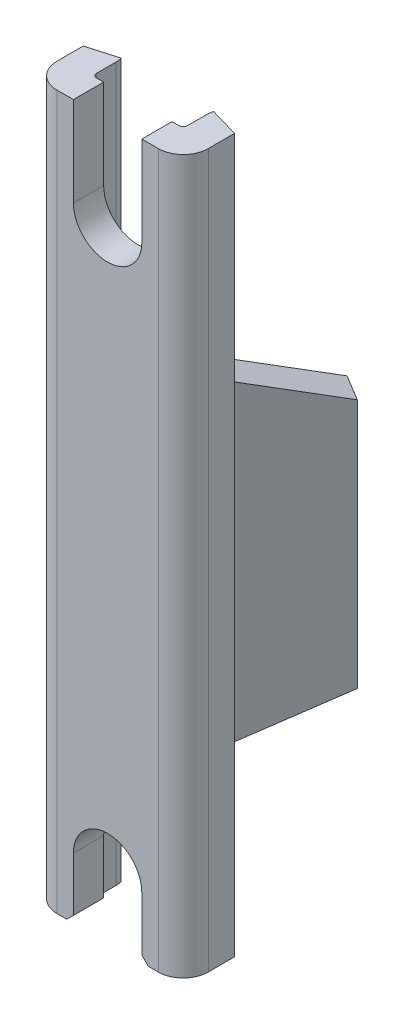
ISO-10303-21;
HEADER;
FILE_DESCRIPTION(('STEP AP214'),'2;1');
FILE_NAME('part.step','',(''),(''),'','','');
FILE_SCHEMA(('AUTOMOTIVE_DESIGN { 1 0 10303 214 1 1 1 1 }'));
ENDSEC;
DATA;
#1=APPLICATION_CONTEXT('core data for automotive mechanical design processes');
#2=APPLICATION_PROTOCOL_DEFINITION('international standard','automotive_design',2000,#1);
#3=PRODUCT_CONTEXT('',#1,'mechanical');
#4=PRODUCT('Part','Part','',(#3));
#5=PRODUCT_RELATED_PRODUCT_CATEGORY('part','',(#4));
#6=PRODUCT_DEFINITION_FORMATION('','',#4);
#7=PRODUCT_DEFINITION_CONTEXT('part definition',#1,'design');
#8=PRODUCT_DEFINITION('design','',#6,#7);
#9=PRODUCT_DEFINITION_SHAPE('','',#8);
#10=(LENGTH_UNIT() NAMED_UNIT(*) SI_UNIT(.MILLI.,.METRE.));
#11=(NAMED_UNIT(*) PLANE_ANGLE_UNIT() SI_UNIT($,.RADIAN.));
#12=(NAMED_UNIT(*) SI_UNIT($,.STERADIAN.) SOLID_ANGLE_UNIT());
#13=UNCERTAINTY_MEASURE_WITH_UNIT(LENGTH_MEASURE(1.E-05),#10,'distance_accuracy_value','');
#14=(GEOMETRIC_REPRESENTATION_CONTEXT(3) GLOBAL_UNCERTAINTY_ASSIGNED_CONTEXT((#13)) GLOBAL_UNIT_ASSIGNED_CONTEXT((#10,
#11,#12)) REPRESENTATION_CONTEXT('',''));
#15=CARTESIAN_POINT('',(0.,0.,0.));
#16=DIRECTION('',(0.,0.,1.));
#17=DIRECTION('',(1.,0.,0.));
#18=AXIS2_PLACEMENT_3D('',#15,#16,#17);
#19=CARTESIAN_POINT('',(0.,28.2,0.));
#20=DIRECTION('',(0.,1.,0.));
#21=DIRECTION('',(0.,0.,1.));
#22=AXIS2_PLACEMENT_3D('',#19,#20,#21);
#23=PLANE('',#22);
#24=DIRECTION('',(0.,0.,1.));
#25=VECTOR('',#24,1.);
#26=CARTESIAN_POINT('',(-2.6,28.2,-10.9133252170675));
#27=LINE('',#26,#25);
#28=CARTESIAN_POINT('',(-2.6,28.2,-2.3));
#29=VERTEX_POINT('',#28);
#30=CARTESIAN_POINT('',(-2.6,28.2,0.));
#31=VERTEX_POINT('',#30);
#32=EDGE_CURVE('E287',#29,#31,#27,.T.);
#33=ORIENTED_EDGE('',*,*,#32,.F.);
#34=DIRECTION('',(-1.,0.,0.));
#35=VECTOR('',#34,1.);
#36=CARTESIAN_POINT('',(3.44999999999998,28.2,-2.3));
#37=LINE('',#36,#35);
#38=CARTESIAN_POINT('',(-3.14999999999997,28.2,-2.3));
#39=VERTEX_POINT('',#38);
#40=EDGE_CURVE('E469',#29,#39,#37,.T.);
#41=ORIENTED_EDGE('',*,*,#40,.T.);
#42=CARTESIAN_POINT('',(-3.14999999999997,28.2,-2.6));
#43=DIRECTION('',(0.,-1.,0.));
#44=DIRECTION('',(0.,0.,1.));
#45=AXIS2_PLACEMENT_3D('',#42,#43,#44);
#46=CIRCLE('',#45,0.3);
#47=CARTESIAN_POINT('',(-3.44999999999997,28.2,-2.6));
#48=VERTEX_POINT('',#47);
#49=EDGE_CURVE('E412',#48,#39,#46,.F.);
#50=ORIENTED_EDGE('',*,*,#49,.F.);
#51=DIRECTION('',(0.,0.,1.));
#52=VECTOR('',#51,1.);
#53=CARTESIAN_POINT('',(-3.44999999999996,28.2,-4.53784645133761));
#54=LINE('',#53,#52);
#55=CARTESIAN_POINT('',(-3.44999999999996,28.2,-4.09412718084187));
#56=VERTEX_POINT('',#55);
#57=EDGE_CURVE('E386',#56,#48,#54,.T.);
#58=ORIENTED_EDGE('',*,*,#57,.F.);
#59=CARTESIAN_POINT('',(-5.04999999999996,28.2,-4.09412718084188));
#60=DIRECTION('',(0.,-1.,0.));
#61=DIRECTION('',(0.,0.,1.));
#62=AXIS2_PLACEMENT_3D('',#59,#60,#61);
#63=CIRCLE('',#62,1.6);
#64=CARTESIAN_POINT('',(-3.51374065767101,28.2,-4.54123704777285));
#65=VERTEX_POINT('',#64);
#66=EDGE_CURVE('E425',#65,#56,#63,.T.);
#67=ORIENTED_EDGE('',*,*,#66,.F.);
#68=DIRECTION('',(0.96126169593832,0.,-0.275637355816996));
#69=VECTOR('',#68,1.);
#70=CARTESIAN_POINT('',(-1.470204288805,28.2,-5.12721167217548));
#71=LINE('',#70,#69);
#72=CARTESIAN_POINT('',(-5.74999999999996,28.2,-3.9));
#73=VERTEX_POINT('',#72);
#74=EDGE_CURVE('E370',#73,#65,#71,.T.);
#75=ORIENTED_EDGE('',*,*,#74,.F.);
#76=DIRECTION('',(0.,0.,-1.));
#77=VECTOR('',#76,1.);
#78=CARTESIAN_POINT('',(-5.75,28.2,0.));
#79=LINE('',#78,#77);
#80=CARTESIAN_POINT('',(-5.74999999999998,28.2,-1.90000000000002));
#81=VERTEX_POINT('',#80);
#82=EDGE_CURVE('E381',#81,#73,#79,.T.);
#83=ORIENTED_EDGE('',*,*,#82,.F.);
#84=CARTESIAN_POINT('',(-3.84999999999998,28.2,-1.9));
#85=DIRECTION('',(0.,-1.,0.));
#86=DIRECTION('',(0.,0.,1.));
#87=AXIS2_PLACEMENT_3D('',#84,#85,#86);
#88=CIRCLE('',#87,1.9);
#89=CARTESIAN_POINT('',(-3.84999999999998,28.2,0.));
#90=VERTEX_POINT('',#89);
#91=EDGE_CURVE('E404',#90,#81,#88,.T.);
#92=ORIENTED_EDGE('',*,*,#91,.F.);
#93=DIRECTION('',(1.,0.,0.));
#94=VECTOR('',#93,1.);
#95=CARTESIAN_POINT('',(0.,28.2,0.));
#96=LINE('',#95,#94);
#97=EDGE_CURVE('E462',#90,#31,#96,.T.);
#98=ORIENTED_EDGE('',*,*,#97,.T.);
#99=EDGE_LOOP('',(#33,#41,#50,#58,#67,#75,#83,#92,#98));
#100=FACE_BOUND('',#99,.T.);
#101=ADVANCED_FACE('F50',(#100),#23,.T.);
#102=CARTESIAN_POINT('',(-9.25225890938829,-26.,80.3161799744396));
#103=DIRECTION('',(0.,1.,0.));
#104=DIRECTION('',(0.,0.,1.));
#105=AXIS2_PLACEMENT_3D('',#102,#103,#104);
#106=PLANE('',#105);
#107=DIRECTION('',(-1.,0.,0.));
#108=VECTOR('',#107,1.);
#109=CARTESIAN_POINT('',(3.44999999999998,-26.,-2.3));
#110=LINE('',#109,#108);
#111=CARTESIAN_POINT('',(-3.1,-26.,-2.3));
#112=VERTEX_POINT('',#111);
#113=CARTESIAN_POINT('',(-3.14999999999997,-26.,-2.3));
#114=VERTEX_POINT('',#113);
#115=EDGE_CURVE('E333',#112,#114,#110,.T.);
#116=ORIENTED_EDGE('',*,*,#115,.F.);
#117=DIRECTION('',(0.,0.,1.));
#118=VECTOR('',#117,1.);
#119=CARTESIAN_POINT('',(-3.1,-26.,80.3161799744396));
#120=LINE('',#119,#118);
#121=CARTESIAN_POINT('',(-3.1,-26.,0.));
#122=VERTEX_POINT('',#121);
#123=EDGE_CURVE('E518',#112,#122,#120,.T.);
#124=ORIENTED_EDGE('',*,*,#123,.T.);
#125=DIRECTION('',(1.,0.,0.));
#126=VECTOR('',#125,1.);
#127=CARTESIAN_POINT('',(0.,-26.,0.));
#128=LINE('',#127,#126);
#129=CARTESIAN_POINT('',(-3.84999999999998,-26.,0.));
#130=VERTEX_POINT('',#129);
#131=EDGE_CURVE('E337',#130,#122,#128,.T.);
#132=ORIENTED_EDGE('',*,*,#131,.F.);
#133=CARTESIAN_POINT('',(-3.84999999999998,-26.,-1.9));
#134=DIRECTION('',(0.,1.,0.));
#135=DIRECTION('',(0.,0.,1.));
#136=AXIS2_PLACEMENT_3D('',#133,#134,#135);
#137=CIRCLE('',#136,1.9);
#138=CARTESIAN_POINT('',(-5.74999999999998,-26.,-1.90000000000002));
#139=VERTEX_POINT('',#138);
#140=EDGE_CURVE('E330',#130,#139,#137,.F.);
#141=ORIENTED_EDGE('',*,*,#140,.T.);
#142=DIRECTION('',(0.,0.,1.));
#143=VECTOR('',#142,1.);
#144=CARTESIAN_POINT('',(-5.75,-26.,0.));
#145=LINE('',#144,#143);
#146=CARTESIAN_POINT('',(-5.74999999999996,-26.,-3.9));
#147=VERTEX_POINT('',#146);
#148=EDGE_CURVE('E326',#147,#139,#145,.T.);
#149=ORIENTED_EDGE('',*,*,#148,.F.);
#150=DIRECTION('',(0.96126169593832,0.,-0.275637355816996));
#151=VECTOR('',#150,1.);
#152=CARTESIAN_POINT('',(-5.74999999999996,-26.,-3.9));
#153=LINE('',#152,#151);
#154=CARTESIAN_POINT('',(-3.51374065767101,-26.,-4.54123704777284));
#155=VERTEX_POINT('',#154);
#156=EDGE_CURVE('E506',#147,#155,#153,.T.);
#157=ORIENTED_EDGE('',*,*,#156,.T.);
#158=CARTESIAN_POINT('',(-5.04999999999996,-26.,-4.09412718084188));
#159=DIRECTION('',(0.,1.,0.));
#160=DIRECTION('',(0.,0.,1.));
#161=AXIS2_PLACEMENT_3D('',#158,#159,#160);
#162=CIRCLE('',#161,1.6);
#163=CARTESIAN_POINT('',(-3.44999999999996,-26.,-4.09412718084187));
#164=VERTEX_POINT('',#163);
#165=EDGE_CURVE('E321',#155,#164,#162,.F.);
#166=ORIENTED_EDGE('',*,*,#165,.T.);
#167=DIRECTION('',(0.,0.,-1.));
#168=VECTOR('',#167,1.);
#169=CARTESIAN_POINT('',(-3.44999999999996,-26.,-4.53784645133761));
#170=LINE('',#169,#168);
#171=CARTESIAN_POINT('',(-3.44999999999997,-26.,-2.6));
#172=VERTEX_POINT('',#171);
#173=EDGE_CURVE('E324',#172,#164,#170,.T.);
#174=ORIENTED_EDGE('',*,*,#173,.F.);
#175=CARTESIAN_POINT('',(-3.14999999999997,-26.,-2.6));
#176=DIRECTION('',(0.,1.,0.));
#177=DIRECTION('',(0.,0.,1.));
#178=AXIS2_PLACEMENT_3D('',#175,#176,#177);
#179=CIRCLE('',#178,0.3);
#180=EDGE_CURVE('E328',#114,#172,#179,.F.);
#181=ORIENTED_EDGE('',*,*,#180,.F.);
#182=EDGE_LOOP('',(#116,#124,#132,#141,#149,#157,#166,#174,#181));
#183=FACE_BOUND('',#182,.T.);
#184=ADVANCED_FACE('F600',(#183),#106,.F.);
#185=CARTESIAN_POINT('',(5.74999999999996,28.2,-3.9));
#186=DIRECTION('',(-0.857167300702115,0.,-0.515038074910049));
#187=DIRECTION('',(-0.515038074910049,0.,0.857167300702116));
#188=AXIS2_PLACEMENT_3D('',#185,#186,#187);
#189=PLANE('',#188);
#190=DIRECTION('',(-0.486978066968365,0.32556815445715,0.810467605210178));
#191=VECTOR('',#190,1.);
#192=CARTESIAN_POINT('',(9.25225890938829,9.5,-9.72873764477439));
#193=LINE('',#192,#191);
#194=CARTESIAN_POINT('',(9.25225890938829,9.5,-9.72873764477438));
#195=VERTEX_POINT('',#194);
#196=CARTESIAN_POINT('',(5.74999999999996,11.8414277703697,-3.9));
#197=VERTEX_POINT('',#196);
#198=EDGE_CURVE('E451',#195,#197,#193,.T.);
#199=ORIENTED_EDGE('',*,*,#198,.T.);
#200=DIRECTION('',(0.,-1.,0.));
#201=VECTOR('',#200,1.);
#202=CARTESIAN_POINT('',(5.74999999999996,28.2,-3.9));
#203=LINE('',#202,#201);
#204=CARTESIAN_POINT('',(5.74999999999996,-11.8414277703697,-3.9));
#205=VERTEX_POINT('',#204);
#206=EDGE_CURVE('E477',#197,#205,#203,.T.);
#207=ORIENTED_EDGE('',*,*,#206,.T.);
#208=DIRECTION('',(-0.486978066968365,-0.32556815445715,0.810467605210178));
#209=VECTOR('',#208,1.);
#210=CARTESIAN_POINT('',(9.25225890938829,-9.5,-9.72873764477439));
#211=LINE('',#210,#209);
#212=CARTESIAN_POINT('',(9.25225890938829,-9.5,-9.72873764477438));
#213=VERTEX_POINT('',#212);
#214=EDGE_CURVE('E431',#213,#205,#211,.T.);
#215=ORIENTED_EDGE('',*,*,#214,.F.);
#216=DIRECTION('',(0.,-1.,0.));
#217=VECTOR('',#216,1.);
#218=CARTESIAN_POINT('',(9.25225890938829,28.2,-9.72873764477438));
#219=LINE('',#218,#217);
#220=EDGE_CURVE('E475',#195,#213,#219,.T.);
#221=ORIENTED_EDGE('',*,*,#220,.F.);
#222=EDGE_LOOP('',(#199,#207,#215,#221));
#223=FACE_BOUND('',#222,.T.);
#224=ADVANCED_FACE('F565',(#223),#189,.F.);
#225=CARTESIAN_POINT('',(9.25225890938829,28.2,-9.72873764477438));
#226=DIRECTION('',(-0.51503807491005,0.,0.857167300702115));
#227=DIRECTION('',(0.857167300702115,0.,0.51503807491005));
#228=AXIS2_PLACEMENT_3D('',#225,#226,#227);
#229=PLANE('',#228);
#230=DIRECTION('',(0.857167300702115,0.,0.515038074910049));
#231=VECTOR('',#230,1.);
#232=CARTESIAN_POINT('',(-12.1769236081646,9.5,-22.6046895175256));
#233=LINE('',#232,#231);
#234=CARTESIAN_POINT('',(7.28077411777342,9.5,-10.9133252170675));
#235=VERTEX_POINT('',#234);
#236=EDGE_CURVE('E454',#235,#195,#233,.T.);
#237=ORIENTED_EDGE('',*,*,#236,.T.);
#238=ORIENTED_EDGE('',*,*,#220,.T.);
#239=DIRECTION('',(0.857167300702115,0.,0.515038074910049));
#240=VECTOR('',#239,1.);
#241=CARTESIAN_POINT('',(-12.1769236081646,-9.5,-22.6046895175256));
#242=LINE('',#241,#240);
#243=CARTESIAN_POINT('',(7.28077411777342,-9.5,-10.9133252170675));
#244=VERTEX_POINT('',#243);
#245=EDGE_CURVE('E434',#244,#213,#242,.T.);
#246=ORIENTED_EDGE('',*,*,#245,.F.);
#247=DIRECTION('',(0.,-1.,0.));
#248=VECTOR('',#247,1.);
#249=CARTESIAN_POINT('',(7.28077411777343,28.2,-10.9133252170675));
#250=LINE('',#249,#248);
#251=EDGE_CURVE('E473',#235,#244,#250,.T.);
#252=ORIENTED_EDGE('',*,*,#251,.F.);
#253=EDGE_LOOP('',(#237,#238,#246,#252));
#254=FACE_BOUND('',#253,.T.);
#255=ADVANCED_FACE('F592',(#254),#229,.F.);
#256=CARTESIAN_POINT('',(7.28077411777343,28.2,-10.9133252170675));
#257=DIRECTION('',(0.857167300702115,0.,0.515038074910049));
#258=DIRECTION('',(0.515038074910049,0.,-0.857167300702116));
#259=AXIS2_PLACEMENT_3D('',#256,#257,#258);
#260=PLANE('',#259);
#261=ORIENTED_EDGE('',*,*,#251,.T.);
#262=DIRECTION('',(0.486978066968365,0.32556815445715,-0.810467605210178));
#263=VECTOR('',#262,1.);
#264=CARTESIAN_POINT('',(7.28077411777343,-9.5,-10.9133252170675));
#265=LINE('',#264,#263);
#266=CARTESIAN_POINT('',(3.67853231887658,-11.9082711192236,-4.91818810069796));
#267=VERTEX_POINT('',#266);
#268=EDGE_CURVE('E437',#267,#244,#265,.T.);
#269=ORIENTED_EDGE('',*,*,#268,.F.);
#270=DIRECTION('',(0.,-1.,0.));
#271=VECTOR('',#270,1.);
#272=CARTESIAN_POINT('',(3.67853231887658,28.2,-4.91818810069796));
#273=LINE('',#272,#271);
#274=CARTESIAN_POINT('',(3.67853231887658,11.9082711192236,-4.91818810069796));
#275=VERTEX_POINT('',#274);
#276=EDGE_CURVE('E498',#267,#275,#273,.F.);
#277=ORIENTED_EDGE('',*,*,#276,.T.);
#278=DIRECTION('',(0.486978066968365,-0.32556815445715,-0.810467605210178));
#279=VECTOR('',#278,1.);
#280=CARTESIAN_POINT('',(7.28077411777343,9.5,-10.9133252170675));
#281=LINE('',#280,#279);
#282=EDGE_CURVE('E457',#275,#235,#281,.T.);
#283=ORIENTED_EDGE('',*,*,#282,.T.);
#284=EDGE_LOOP('',(#261,#269,#277,#283));
#285=FACE_BOUND('',#284,.T.);
#286=ADVANCED_FACE('F590',(#285),#260,.F.);
#287=DIRECTION('',(0.,0.,1.));
#288=VECTOR('',#287,1.);
#289=CARTESIAN_POINT('',(2.6,28.2,-10.9133252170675));
#290=LINE('',#289,#288);
#291=CARTESIAN_POINT('',(2.6,28.2,-2.3));
#292=VERTEX_POINT('',#291);
#293=CARTESIAN_POINT('',(2.6,28.2,0.));
#294=VERTEX_POINT('',#293);
#295=EDGE_CURVE('E300',#292,#294,#290,.T.);
#296=ORIENTED_EDGE('',*,*,#295,.T.);
#297=CARTESIAN_POINT('',(3.84999999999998,28.2,0.));
#298=VERTEX_POINT('',#297);
#299=EDGE_CURVE('E459',#294,#298,#96,.T.);
#300=ORIENTED_EDGE('',*,*,#299,.T.);
#301=CARTESIAN_POINT('',(3.84999999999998,28.2,-1.9));
#302=DIRECTION('',(0.,1.,0.));
#303=DIRECTION('',(0.,0.,1.));
#304=AXIS2_PLACEMENT_3D('',#301,#302,#303);
#305=CIRCLE('',#304,1.9);
#306=CARTESIAN_POINT('',(5.74999999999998,28.2,-1.90000000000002));
#307=VERTEX_POINT('',#306);
#308=EDGE_CURVE('E486',#298,#307,#305,.T.);
#309=ORIENTED_EDGE('',*,*,#308,.T.);
#310=DIRECTION('',(0.,0.,-1.));
#311=VECTOR('',#310,1.);
#312=CARTESIAN_POINT('',(5.75,28.2,0.));
#313=LINE('',#312,#311);
#314=CARTESIAN_POINT('',(5.74999999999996,28.2,-3.9));
#315=VERTEX_POINT('',#314);
#316=EDGE_CURVE('E464',#307,#315,#313,.T.);
#317=ORIENTED_EDGE('',*,*,#316,.T.);
#318=DIRECTION('',(-0.96126169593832,0.,-0.275637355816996));
#319=VECTOR('',#318,1.);
#320=CARTESIAN_POINT('',(1.470204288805,28.2,-5.12721167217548));
#321=LINE('',#320,#319);
#322=CARTESIAN_POINT('',(3.51374065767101,28.2,-4.54123704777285));
#323=VERTEX_POINT('',#322);
#324=EDGE_CURVE('E447',#315,#323,#321,.T.);
#325=ORIENTED_EDGE('',*,*,#324,.T.);
#326=CARTESIAN_POINT('',(5.04999999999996,28.2,-4.09412718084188));
#327=DIRECTION('',(0.,1.,0.));
#328=DIRECTION('',(0.,0.,1.));
#329=AXIS2_PLACEMENT_3D('',#326,#327,#328);
#330=CIRCLE('',#329,1.6);
#331=CARTESIAN_POINT('',(3.44999999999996,28.2,-4.09412718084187));
#332=VERTEX_POINT('',#331);
#333=EDGE_CURVE('E504',#323,#332,#330,.T.);
#334=ORIENTED_EDGE('',*,*,#333,.T.);
#335=DIRECTION('',(0.,0.,1.));
#336=VECTOR('',#335,1.);
#337=CARTESIAN_POINT('',(3.44999999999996,28.2,-4.53784645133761));
#338=LINE('',#337,#336);
#339=CARTESIAN_POINT('',(3.44999999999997,28.2,-2.6));
#340=VERTEX_POINT('',#339);
#341=EDGE_CURVE('E466',#332,#340,#338,.T.);
#342=ORIENTED_EDGE('',*,*,#341,.T.);
#343=CARTESIAN_POINT('',(3.14999999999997,28.2,-2.6));
#344=DIRECTION('',(0.,1.,0.));
#345=DIRECTION('',(0.,0.,1.));
#346=AXIS2_PLACEMENT_3D('',#343,#344,#345);
#347=CIRCLE('',#346,0.3);
#348=CARTESIAN_POINT('',(3.14999999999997,28.2,-2.3));
#349=VERTEX_POINT('',#348);
#350=EDGE_CURVE('E493',#340,#349,#347,.F.);
#351=ORIENTED_EDGE('',*,*,#350,.T.);
#352=EDGE_CURVE('E470',#349,#292,#37,.T.);
#353=ORIENTED_EDGE('',*,*,#352,.T.);
#354=EDGE_LOOP('',(#296,#300,#309,#317,#325,#334,#342,#351,#353));
#355=FACE_BOUND('',#354,.T.);
#356=ADVANCED_FACE('F579',(#355),#23,.T.);
#357=CARTESIAN_POINT('',(0.,28.2,0.));
#358=DIRECTION('',(0.,0.,-1.));
#359=DIRECTION('',(-1.,0.,0.));
#360=AXIS2_PLACEMENT_3D('',#357,#358,#359);
#361=PLANE('',#360);
#362=ORIENTED_EDGE('',*,*,#131,.T.);
#363=DIRECTION('',(-0.707106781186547,-0.707106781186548,0.));
#364=VECTOR('',#363,1.);
#365=CARTESIAN_POINT('',(-3.1,-26.,0.));
#366=LINE('',#365,#364);
#367=CARTESIAN_POINT('',(-2.6,-25.5,0.));
#368=VERTEX_POINT('',#367);
#369=EDGE_CURVE('E523',#122,#368,#366,.F.);
#370=ORIENTED_EDGE('',*,*,#369,.T.);
#371=DIRECTION('',(0.,-1.,0.));
#372=VECTOR('',#371,1.);
#373=CARTESIAN_POINT('',(-2.6,-26.,0.));
#374=LINE('',#373,#372);
#375=CARTESIAN_POINT('',(-2.6,-21.4,0.));
#376=VERTEX_POINT('',#375);
#377=EDGE_CURVE('E308',#376,#368,#374,.T.);
#378=ORIENTED_EDGE('',*,*,#377,.F.);
#379=CARTESIAN_POINT('',(0.,-21.4,0.));
#380=DIRECTION('',(0.,0.,1.));
#381=DIRECTION('',(-1.,0.,0.));
#382=AXIS2_PLACEMENT_3D('',#379,#380,#381);
#383=CIRCLE('',#382,2.6);
#384=CARTESIAN_POINT('',(2.6,-21.4,0.));
#385=VERTEX_POINT('',#384);
#386=EDGE_CURVE('E305',#385,#376,#383,.T.);
#387=ORIENTED_EDGE('',*,*,#386,.F.);
#388=DIRECTION('',(0.,1.,0.));
#389=VECTOR('',#388,1.);
#390=CARTESIAN_POINT('',(2.6,-26.,0.));
#391=LINE('',#390,#389);
#392=CARTESIAN_POINT('',(2.6,-25.5,0.));
#393=VERTEX_POINT('',#392);
#394=EDGE_CURVE('E299',#393,#385,#391,.T.);
#395=ORIENTED_EDGE('',*,*,#394,.F.);
#396=DIRECTION('',(-0.707106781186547,0.707106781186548,0.));
#397=VECTOR('',#396,1.);
#398=CARTESIAN_POINT('',(3.1,-26.,0.));
#399=LINE('',#398,#397);
#400=CARTESIAN_POINT('',(3.1,-26.,0.));
#401=VERTEX_POINT('',#400);
#402=EDGE_CURVE('E521',#393,#401,#399,.F.);
#403=ORIENTED_EDGE('',*,*,#402,.T.);
#404=CARTESIAN_POINT('',(3.84999999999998,-26.,0.));
#405=VERTEX_POINT('',#404);
#406=EDGE_CURVE('E336',#401,#405,#128,.T.);
#407=ORIENTED_EDGE('',*,*,#406,.T.);
#408=DIRECTION('',(0.,-1.,0.));
#409=VECTOR('',#408,1.);
#410=CARTESIAN_POINT('',(3.84999999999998,28.2,0.));
#411=LINE('',#410,#409);
#412=EDGE_CURVE('E483',#405,#298,#411,.F.);
#413=ORIENTED_EDGE('',*,*,#412,.T.);
#414=ORIENTED_EDGE('',*,*,#299,.F.);
#415=DIRECTION('',(0.,1.,0.));
#416=VECTOR('',#415,1.);
#417=CARTESIAN_POINT('',(2.6,28.2,0.));
#418=LINE('',#417,#416);
#419=CARTESIAN_POINT('',(2.6,21.4,0.));
#420=VERTEX_POINT('',#419);
#421=EDGE_CURVE('E281',#420,#294,#418,.T.);
#422=ORIENTED_EDGE('',*,*,#421,.F.);
#423=CARTESIAN_POINT('',(0.,21.4,0.));
#424=DIRECTION('',(0.,0.,1.));
#425=DIRECTION('',(1.,0.,0.));
#426=AXIS2_PLACEMENT_3D('',#423,#424,#425);
#427=CIRCLE('',#426,2.6);
#428=CARTESIAN_POINT('',(-2.6,21.4,0.));
#429=VERTEX_POINT('',#428);
#430=EDGE_CURVE('E274',#429,#420,#427,.T.);
#431=ORIENTED_EDGE('',*,*,#430,.F.);
#432=DIRECTION('',(0.,-1.,0.));
#433=VECTOR('',#432,1.);
#434=CARTESIAN_POINT('',(-2.6,28.2,0.));
#435=LINE('',#434,#433);
#436=EDGE_CURVE('E284',#31,#429,#435,.T.);
#437=ORIENTED_EDGE('',*,*,#436,.F.);
#438=ORIENTED_EDGE('',*,*,#97,.F.);
#439=DIRECTION('',(0.,-1.,0.));
#440=VECTOR('',#439,1.);
#441=CARTESIAN_POINT('',(-3.84999999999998,28.2,0.));
#442=LINE('',#441,#440);
#443=EDGE_CURVE('E402',#130,#90,#442,.F.);
#444=ORIENTED_EDGE('',*,*,#443,.F.);
#445=EDGE_LOOP('',(#362,#370,#378,#387,#395,#403,#407,#413,#414,#422,#431,#437,#438,#444));
#446=FACE_BOUND('',#445,.T.);
#447=ADVANCED_FACE('F293',(#446),#361,.F.);
#448=CARTESIAN_POINT('',(5.75,28.2,0.));
#449=DIRECTION('',(-1.,0.,0.));
#450=DIRECTION('',(0.,0.,1.));
#451=AXIS2_PLACEMENT_3D('',#448,#449,#450);
#452=PLANE('',#451);
#453=DIRECTION('',(0.,-1.,0.));
#454=VECTOR('',#453,1.);
#455=CARTESIAN_POINT('',(5.74999999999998,28.2,-1.90000000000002));
#456=LINE('',#455,#454);
#457=CARTESIAN_POINT('',(5.74999999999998,-26.,-1.90000000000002));
#458=VERTEX_POINT('',#457);
#459=EDGE_CURVE('E480',#307,#458,#456,.T.);
#460=ORIENTED_EDGE('',*,*,#459,.T.);
#461=DIRECTION('',(0.,0.,-1.));
#462=VECTOR('',#461,1.);
#463=CARTESIAN_POINT('',(5.75,-26.,0.));
#464=LINE('',#463,#462);
#465=CARTESIAN_POINT('',(5.74999999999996,-26.,-3.9));
#466=VERTEX_POINT('',#465);
#467=EDGE_CURVE('E346',#458,#466,#464,.T.);
#468=ORIENTED_EDGE('',*,*,#467,.T.);
#469=DIRECTION('',(0.,1.,0.));
#470=VECTOR('',#469,1.);
#471=CARTESIAN_POINT('',(5.74999999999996,-28.2,-3.9));
#472=LINE('',#471,#470);
#473=EDGE_CURVE('E440',#466,#205,#472,.T.);
#474=ORIENTED_EDGE('',*,*,#473,.T.);
#475=ORIENTED_EDGE('',*,*,#206,.F.);
#476=EDGE_CURVE('E478',#315,#197,#203,.T.);
#477=ORIENTED_EDGE('',*,*,#476,.F.);
#478=ORIENTED_EDGE('',*,*,#316,.F.);
#479=EDGE_LOOP('',(#460,#468,#474,#475,#477,#478));
#480=FACE_BOUND('',#479,.T.);
#481=ADVANCED_FACE('F569',(#480),#452,.F.);
#482=CARTESIAN_POINT('',(3.44999999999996,28.2,-4.53784645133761));
#483=DIRECTION('',(1.,0.,0.));
#484=DIRECTION('',(0.,0.,-1.));
#485=AXIS2_PLACEMENT_3D('',#482,#483,#484);
#486=PLANE('',#485);
#487=DIRECTION('',(0.,-1.,0.));
#488=VECTOR('',#487,1.);
#489=CARTESIAN_POINT('',(3.44999999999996,28.2,-4.09412718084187));
#490=LINE('',#489,#488);
#491=CARTESIAN_POINT('',(3.44999999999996,-26.,-4.09412718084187));
#492=VERTEX_POINT('',#491);
#493=EDGE_CURVE('E495',#332,#492,#490,.T.);
#494=ORIENTED_EDGE('',*,*,#493,.T.);
#495=DIRECTION('',(0.,0.,1.));
#496=VECTOR('',#495,1.);
#497=CARTESIAN_POINT('',(3.44999999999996,-26.,-4.53784645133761));
#498=LINE('',#497,#496);
#499=CARTESIAN_POINT('',(3.44999999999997,-26.,-2.6));
#500=VERTEX_POINT('',#499);
#501=EDGE_CURVE('E344',#492,#500,#498,.T.);
#502=ORIENTED_EDGE('',*,*,#501,.T.);
#503=DIRECTION('',(0.,-1.,0.));
#504=VECTOR('',#503,1.);
#505=CARTESIAN_POINT('',(3.44999999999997,28.2,-2.6));
#506=LINE('',#505,#504);
#507=EDGE_CURVE('E491',#500,#340,#506,.F.);
#508=ORIENTED_EDGE('',*,*,#507,.T.);
#509=ORIENTED_EDGE('',*,*,#341,.F.);
#510=EDGE_LOOP('',(#494,#502,#508,#509));
#511=FACE_BOUND('',#510,.T.);
#512=ADVANCED_FACE('F544',(#511),#486,.F.);
#513=CARTESIAN_POINT('',(3.44999999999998,28.2,-2.3));
#514=DIRECTION('',(0.,0.,1.));
#515=DIRECTION('',(1.,0.,0.));
#516=AXIS2_PLACEMENT_3D('',#513,#514,#515);
#517=PLANE('',#516);
#518=DIRECTION('',(0.,-1.,0.));
#519=VECTOR('',#518,1.);
#520=CARTESIAN_POINT('',(-2.6,28.2,-2.3));
#521=LINE('',#520,#519);
#522=CARTESIAN_POINT('',(-2.6,-21.4,-2.3));
#523=VERTEX_POINT('',#522);
#524=CARTESIAN_POINT('',(-2.59999999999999,-25.5,-2.3));
#525=VERTEX_POINT('',#524);
#526=EDGE_CURVE('E318',#523,#525,#521,.T.);
#527=ORIENTED_EDGE('',*,*,#526,.T.);
#528=DIRECTION('',(0.707106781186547,0.707106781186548,0.));
#529=VECTOR('',#528,1.);
#530=CARTESIAN_POINT('',(-3.1,-26.,-2.3));
#531=LINE('',#530,#529);
#532=EDGE_CURVE('E528',#525,#112,#531,.F.);
#533=ORIENTED_EDGE('',*,*,#532,.T.);
#534=ORIENTED_EDGE('',*,*,#115,.T.);
#535=DIRECTION('',(0.,-1.,0.));
#536=VECTOR('',#535,1.);
#537=CARTESIAN_POINT('',(-3.14999999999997,0.,-2.3));
#538=LINE('',#537,#536);
#539=EDGE_CURVE('E407',#39,#114,#538,.T.);
#540=ORIENTED_EDGE('',*,*,#539,.F.);
#541=ORIENTED_EDGE('',*,*,#40,.F.);
#542=DIRECTION('',(0.,-1.,0.));
#543=VECTOR('',#542,1.);
#544=CARTESIAN_POINT('',(-2.6,28.2,-2.3));
#545=LINE('',#544,#543);
#546=CARTESIAN_POINT('',(-2.6,21.4,-2.3));
#547=VERTEX_POINT('',#546);
#548=EDGE_CURVE('E516',#29,#547,#545,.T.);
#549=ORIENTED_EDGE('',*,*,#548,.T.);
#550=CARTESIAN_POINT('',(0.,21.4,-2.3));
#551=DIRECTION('',(0.,0.,1.));
#552=DIRECTION('',(1.,0.,0.));
#553=AXIS2_PLACEMENT_3D('',#550,#551,#552);
#554=CIRCLE('',#553,2.6);
#555=CARTESIAN_POINT('',(2.6,21.4,-2.3));
#556=VERTEX_POINT('',#555);
#557=EDGE_CURVE('E277',#547,#556,#554,.T.);
#558=ORIENTED_EDGE('',*,*,#557,.T.);
#559=DIRECTION('',(0.,1.,0.));
#560=VECTOR('',#559,1.);
#561=CARTESIAN_POINT('',(2.6,28.2,-2.3));
#562=LINE('',#561,#560);
#563=EDGE_CURVE('E513',#556,#292,#562,.T.);
#564=ORIENTED_EDGE('',*,*,#563,.T.);
#565=ORIENTED_EDGE('',*,*,#352,.F.);
#566=DIRECTION('',(0.,-1.,0.));
#567=VECTOR('',#566,1.);
#568=CARTESIAN_POINT('',(3.14999999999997,0.,-2.3));
#569=LINE('',#568,#567);
#570=CARTESIAN_POINT('',(3.14999999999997,-26.,-2.3));
#571=VERTEX_POINT('',#570);
#572=EDGE_CURVE('E488',#349,#571,#569,.T.);
#573=ORIENTED_EDGE('',*,*,#572,.T.);
#574=CARTESIAN_POINT('',(3.09999999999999,-26.,-2.3));
#575=VERTEX_POINT('',#574);
#576=EDGE_CURVE('E334',#571,#575,#110,.T.);
#577=ORIENTED_EDGE('',*,*,#576,.T.);
#578=DIRECTION('',(0.707106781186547,-0.707106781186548,0.));
#579=VECTOR('',#578,1.);
#580=CARTESIAN_POINT('',(3.09999999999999,-26.,-2.3));
#581=LINE('',#580,#579);
#582=CARTESIAN_POINT('',(2.6,-25.5,-2.3));
#583=VERTEX_POINT('',#582);
#584=EDGE_CURVE('E65',#575,#583,#581,.F.);
#585=ORIENTED_EDGE('',*,*,#584,.T.);
#586=DIRECTION('',(0.,1.,0.));
#587=VECTOR('',#586,1.);
#588=CARTESIAN_POINT('',(2.6,28.2,-2.3));
#589=LINE('',#588,#587);
#590=CARTESIAN_POINT('',(2.6,-21.4,-2.3));
#591=VERTEX_POINT('',#590);
#592=EDGE_CURVE('E314',#583,#591,#589,.T.);
#593=ORIENTED_EDGE('',*,*,#592,.T.);
#594=CARTESIAN_POINT('',(0.,-21.4,-2.3));
#595=DIRECTION('',(0.,0.,1.));
#596=DIRECTION('',(1.,0.,0.));
#597=AXIS2_PLACEMENT_3D('',#594,#595,#596);
#598=CIRCLE('',#597,2.6);
#599=EDGE_CURVE('E509',#591,#523,#598,.T.);
#600=ORIENTED_EDGE('',*,*,#599,.T.);
#601=EDGE_LOOP('',(#527,#533,#534,#540,#541,#549,#558,#564,#565,#573,#577,#585,#593,#600));
#602=FACE_BOUND('',#601,.T.);
#603=ADVANCED_FACE('F535',(#602),#517,.F.);
#604=CARTESIAN_POINT('',(5.74999999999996,0.,-3.9));
#605=DIRECTION('',(0.275637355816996,0.,-0.96126169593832));
#606=DIRECTION('',(-0.96126169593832,0.,-0.275637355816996));
#607=AXIS2_PLACEMENT_3D('',#604,#605,#606);
#608=PLANE('',#607);
#609=DIRECTION('',(-0.957467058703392,0.0887667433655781,-0.274549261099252));
#610=VECTOR('',#609,1.);
#611=CARTESIAN_POINT('',(-15.4023206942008,13.8024588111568,-9.96533035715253));
#612=LINE('',#611,#610);
#613=CARTESIAN_POINT('',(3.51374065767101,12.0487513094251,-4.54123704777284));
#614=VERTEX_POINT('',#613);
#615=EDGE_CURVE('E448',#197,#614,#612,.T.);
#616=ORIENTED_EDGE('',*,*,#615,.T.);
#617=DIRECTION('',(0.,-1.,0.));
#618=VECTOR('',#617,1.);
#619=CARTESIAN_POINT('',(3.51374065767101,12.0487513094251,-4.54123704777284));
#620=LINE('',#619,#618);
#621=EDGE_CURVE('E502',#614,#323,#620,.F.);
#622=ORIENTED_EDGE('',*,*,#621,.T.);
#623=ORIENTED_EDGE('',*,*,#324,.F.);
#624=ORIENTED_EDGE('',*,*,#476,.T.);
#625=EDGE_LOOP('',(#616,#622,#623,#624));
#626=FACE_BOUND('',#625,.T.);
#627=ADVANCED_FACE('F581',(#626),#608,.T.);
#628=CARTESIAN_POINT('',(-12.1769236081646,9.5,-22.6046895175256));
#629=DIRECTION('',(0.167679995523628,0.945518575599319,-0.279066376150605));
#630=DIRECTION('',(0.,0.283074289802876,0.959097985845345));
#631=AXIS2_PLACEMENT_3D('',#628,#629,#630);
#632=PLANE('',#631);
#633=ORIENTED_EDGE('',*,*,#282,.F.);
#634=CARTESIAN_POINT('',(5.04999999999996,11.9082711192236,-4.09412718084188));
#635=DIRECTION('',(0.167679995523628,0.945518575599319,-0.279066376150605));
#636=DIRECTION('',(0.486978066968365,-0.32556815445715,-0.810467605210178));
#637=AXIS2_PLACEMENT_3D('',#634,#635,#636);
#638=ELLIPSE('',#637,1.69219308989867,1.6);
#639=EDGE_CURVE('E500',#275,#614,#638,.T.);
#640=ORIENTED_EDGE('',*,*,#639,.T.);
#641=ORIENTED_EDGE('',*,*,#615,.F.);
#642=ORIENTED_EDGE('',*,*,#198,.F.);
#643=ORIENTED_EDGE('',*,*,#236,.F.);
#644=EDGE_LOOP('',(#633,#640,#641,#642,#643));
#645=FACE_BOUND('',#644,.T.);
#646=ADVANCED_FACE('F586',(#645),#632,.T.);
#647=CARTESIAN_POINT('',(3.84999999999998,28.2,-1.9));
#648=DIRECTION('',(0.,-1.,0.));
#649=DIRECTION('',(0.,0.,-1.));
#650=AXIS2_PLACEMENT_3D('',#647,#648,#649);
#651=CYLINDRICAL_SURFACE('',#650,1.9);
#652=CARTESIAN_POINT('',(3.84999999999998,-26.,-1.9));
#653=DIRECTION('',(0.,1.,0.));
#654=DIRECTION('',(0.,0.,1.));
#655=AXIS2_PLACEMENT_3D('',#652,#653,#654);
#656=CIRCLE('',#655,1.9);
#657=EDGE_CURVE('E341',#458,#405,#656,.F.);
#658=ORIENTED_EDGE('',*,*,#657,.F.);
#659=ORIENTED_EDGE('',*,*,#459,.F.);
#660=ORIENTED_EDGE('',*,*,#308,.F.);
#661=ORIENTED_EDGE('',*,*,#412,.F.);
#662=EDGE_LOOP('',(#658,#659,#660,#661));
#663=FACE_BOUND('',#662,.T.);
#664=ADVANCED_FACE('F575',(#663),#651,.T.);
#665=CARTESIAN_POINT('',(3.14999999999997,28.2,-2.6));
#666=DIRECTION('',(0.,1.,0.));
#667=DIRECTION('',(0.,0.,1.));
#668=AXIS2_PLACEMENT_3D('',#665,#666,#667);
#669=CYLINDRICAL_SURFACE('',#668,0.3);
#670=ORIENTED_EDGE('',*,*,#507,.F.);
#671=CARTESIAN_POINT('',(3.14999999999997,-26.,-2.6));
#672=DIRECTION('',(0.,1.,0.));
#673=DIRECTION('',(0.,0.,1.));
#674=AXIS2_PLACEMENT_3D('',#671,#672,#673);
#675=CIRCLE('',#674,0.3);
#676=EDGE_CURVE('E339',#500,#571,#675,.F.);
#677=ORIENTED_EDGE('',*,*,#676,.T.);
#678=ORIENTED_EDGE('',*,*,#572,.F.);
#679=ORIENTED_EDGE('',*,*,#350,.F.);
#680=EDGE_LOOP('',(#670,#677,#678,#679));
#681=FACE_BOUND('',#680,.T.);
#682=ADVANCED_FACE('F541',(#681),#669,.F.);
#683=CARTESIAN_POINT('',(5.04999999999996,28.2,-4.09412718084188));
#684=DIRECTION('',(0.,-1.,0.));
#685=DIRECTION('',(0.,0.,-1.));
#686=AXIS2_PLACEMENT_3D('',#683,#684,#685);
#687=CYLINDRICAL_SURFACE('',#686,1.6);
#688=CARTESIAN_POINT('',(5.04999999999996,-26.,-4.09412718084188));
#689=DIRECTION('',(0.,1.,0.));
#690=DIRECTION('',(0.,0.,1.));
#691=AXIS2_PLACEMENT_3D('',#688,#689,#690);
#692=CIRCLE('',#691,1.6);
#693=CARTESIAN_POINT('',(3.51374065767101,-26.,-4.54123704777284));
#694=VERTEX_POINT('',#693);
#695=EDGE_CURVE('E351',#492,#694,#692,.F.);
#696=ORIENTED_EDGE('',*,*,#695,.F.);
#697=ORIENTED_EDGE('',*,*,#493,.F.);
#698=ORIENTED_EDGE('',*,*,#333,.F.);
#699=ORIENTED_EDGE('',*,*,#621,.F.);
#700=ORIENTED_EDGE('',*,*,#639,.F.);
#701=ORIENTED_EDGE('',*,*,#276,.F.);
#702=CARTESIAN_POINT('',(5.04999999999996,-11.9082711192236,-4.09412718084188));
#703=DIRECTION('',(-0.167679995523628,0.945518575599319,0.279066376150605));
#704=DIRECTION('',(0.486978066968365,0.32556815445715,-0.810467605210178));
#705=AXIS2_PLACEMENT_3D('',#702,#703,#704);
#706=ELLIPSE('',#705,1.69219308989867,1.6);
#707=CARTESIAN_POINT('',(3.51374065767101,-12.0487513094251,-4.54123704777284));
#708=VERTEX_POINT('',#707);
#709=EDGE_CURVE('E442',#267,#708,#706,.T.);
#710=ORIENTED_EDGE('',*,*,#709,.T.);
#711=DIRECTION('',(0.,1.,0.));
#712=VECTOR('',#711,1.);
#713=CARTESIAN_POINT('',(3.51374065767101,-12.0487513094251,-4.54123704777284));
#714=LINE('',#713,#712);
#715=EDGE_CURVE('E444',#708,#694,#714,.F.);
#716=ORIENTED_EDGE('',*,*,#715,.T.);
#717=EDGE_LOOP('',(#696,#697,#698,#699,#700,#701,#710,#716));
#718=FACE_BOUND('',#717,.T.);
#719=ADVANCED_FACE('F549',(#718),#687,.T.);
#720=CARTESIAN_POINT('',(5.74999999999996,0.,-3.9));
#721=DIRECTION('',(0.275637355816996,0.,-0.96126169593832));
#722=DIRECTION('',(-0.96126169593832,0.,-0.275637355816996));
#723=AXIS2_PLACEMENT_3D('',#720,#721,#722);
#724=PLANE('',#723);
#725=DIRECTION('',(0.96126169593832,0.,0.275637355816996));
#726=VECTOR('',#725,1.);
#727=CARTESIAN_POINT('',(5.74999999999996,-26.,-3.9));
#728=LINE('',#727,#726);
#729=EDGE_CURVE('E348',#694,#466,#728,.T.);
#730=ORIENTED_EDGE('',*,*,#729,.F.);
#731=ORIENTED_EDGE('',*,*,#715,.F.);
#732=DIRECTION('',(-0.957467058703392,-0.0887667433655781,-0.274549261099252));
#733=VECTOR('',#732,1.);
#734=CARTESIAN_POINT('',(-15.4023206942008,-13.8024588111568,-9.96533035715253));
#735=LINE('',#734,#733);
#736=EDGE_CURVE('E428',#205,#708,#735,.T.);
#737=ORIENTED_EDGE('',*,*,#736,.F.);
#738=ORIENTED_EDGE('',*,*,#473,.F.);
#739=EDGE_LOOP('',(#730,#731,#737,#738));
#740=FACE_BOUND('',#739,.T.);
#741=ADVANCED_FACE('F555',(#740),#724,.T.);
#742=CARTESIAN_POINT('',(-12.1769236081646,-9.5,-22.6046895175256));
#743=DIRECTION('',(0.167679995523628,-0.945518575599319,-0.279066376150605));
#744=DIRECTION('',(0.,-0.283074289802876,0.959097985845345));
#745=AXIS2_PLACEMENT_3D('',#742,#743,#744);
#746=PLANE('',#745);
#747=ORIENTED_EDGE('',*,*,#268,.T.);
#748=ORIENTED_EDGE('',*,*,#245,.T.);
#749=ORIENTED_EDGE('',*,*,#214,.T.);
#750=ORIENTED_EDGE('',*,*,#736,.T.);
#751=ORIENTED_EDGE('',*,*,#709,.F.);
#752=EDGE_LOOP('',(#747,#748,#749,#750,#751));
#753=FACE_BOUND('',#752,.T.);
#754=ADVANCED_FACE('F558',(#753),#746,.T.);
#755=CARTESIAN_POINT('',(-5.74999999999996,28.2,-3.9));
#756=DIRECTION('',(0.857167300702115,0.,-0.515038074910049));
#757=DIRECTION('',(0.515038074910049,0.,0.857167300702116));
#758=AXIS2_PLACEMENT_3D('',#755,#756,#757);
#759=PLANE('',#758);
#760=DIRECTION('',(0.486978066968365,0.32556815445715,0.810467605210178));
#761=VECTOR('',#760,1.);
#762=CARTESIAN_POINT('',(-9.25225890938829,9.5,-9.72873764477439));
#763=LINE('',#762,#761);
#764=CARTESIAN_POINT('',(-9.25225890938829,9.5,-9.72873764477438));
#765=VERTEX_POINT('',#764);
#766=CARTESIAN_POINT('',(-5.74999999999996,11.8414277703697,-3.9));
#767=VERTEX_POINT('',#766);
#768=EDGE_CURVE('E374',#765,#767,#763,.T.);
#769=ORIENTED_EDGE('',*,*,#768,.F.);
#770=DIRECTION('',(0.,-1.,0.));
#771=VECTOR('',#770,1.);
#772=CARTESIAN_POINT('',(-9.25225890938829,28.2,-9.72873764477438));
#773=LINE('',#772,#771);
#774=CARTESIAN_POINT('',(-9.25225890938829,-9.5,-9.72873764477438));
#775=VERTEX_POINT('',#774);
#776=EDGE_CURVE('E392',#765,#775,#773,.T.);
#777=ORIENTED_EDGE('',*,*,#776,.T.);
#778=DIRECTION('',(0.486978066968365,-0.32556815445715,0.810467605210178));
#779=VECTOR('',#778,1.);
#780=CARTESIAN_POINT('',(-9.25225890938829,-9.5,-9.72873764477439));
#781=LINE('',#780,#779);
#782=CARTESIAN_POINT('',(-5.74999999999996,-11.8414277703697,-3.9));
#783=VERTEX_POINT('',#782);
#784=EDGE_CURVE('E356',#775,#783,#781,.T.);
#785=ORIENTED_EDGE('',*,*,#784,.T.);
#786=DIRECTION('',(0.,-1.,0.));
#787=VECTOR('',#786,1.);
#788=CARTESIAN_POINT('',(-5.74999999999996,28.2,-3.9));
#789=LINE('',#788,#787);
#790=EDGE_CURVE('E395',#767,#783,#789,.T.);
#791=ORIENTED_EDGE('',*,*,#790,.F.);
#792=EDGE_LOOP('',(#769,#777,#785,#791));
#793=FACE_BOUND('',#792,.T.);
#794=ADVANCED_FACE('F697',(#793),#759,.F.);
#795=CARTESIAN_POINT('',(-9.25225890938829,28.2,-9.72873764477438));
#796=DIRECTION('',(0.51503807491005,0.,0.857167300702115));
#797=DIRECTION('',(-0.857167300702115,0.,0.51503807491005));
#798=AXIS2_PLACEMENT_3D('',#795,#796,#797);
#799=PLANE('',#798);
#800=DIRECTION('',(-0.857167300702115,0.,0.515038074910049));
#801=VECTOR('',#800,1.);
#802=CARTESIAN_POINT('',(12.1769236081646,9.5,-22.6046895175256));
#803=LINE('',#802,#801);
#804=CARTESIAN_POINT('',(-7.28077411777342,9.5,-10.9133252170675));
#805=VERTEX_POINT('',#804);
#806=EDGE_CURVE('E377',#805,#765,#803,.T.);
#807=ORIENTED_EDGE('',*,*,#806,.F.);
#808=DIRECTION('',(0.,-1.,0.));
#809=VECTOR('',#808,1.);
#810=CARTESIAN_POINT('',(-7.28077411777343,28.2,-10.9133252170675));
#811=LINE('',#810,#809);
#812=CARTESIAN_POINT('',(-7.28077411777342,-9.5,-10.9133252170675));
#813=VERTEX_POINT('',#812);
#814=EDGE_CURVE('E389',#805,#813,#811,.T.);
#815=ORIENTED_EDGE('',*,*,#814,.T.);
#816=DIRECTION('',(-0.857167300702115,0.,0.515038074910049));
#817=VECTOR('',#816,1.);
#818=CARTESIAN_POINT('',(12.1769236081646,-9.5,-22.6046895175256));
#819=LINE('',#818,#817);
#820=EDGE_CURVE('E359',#813,#775,#819,.T.);
#821=ORIENTED_EDGE('',*,*,#820,.T.);
#822=ORIENTED_EDGE('',*,*,#776,.F.);
#823=EDGE_LOOP('',(#807,#815,#821,#822));
#824=FACE_BOUND('',#823,.T.);
#825=ADVANCED_FACE('F705',(#824),#799,.F.);
#826=CARTESIAN_POINT('',(-7.28077411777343,28.2,-10.9133252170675));
#827=DIRECTION('',(-0.857167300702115,0.,0.515038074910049));
#828=DIRECTION('',(-0.515038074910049,0.,-0.857167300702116));
#829=AXIS2_PLACEMENT_3D('',#826,#827,#828);
#830=PLANE('',#829);
#831=ORIENTED_EDGE('',*,*,#814,.F.);
#832=DIRECTION('',(-0.486978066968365,-0.32556815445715,-0.810467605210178));
#833=VECTOR('',#832,1.);
#834=CARTESIAN_POINT('',(-7.28077411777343,9.5,-10.9133252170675));
#835=LINE('',#834,#833);
#836=CARTESIAN_POINT('',(-3.67853231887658,11.9082711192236,-4.91818810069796));
#837=VERTEX_POINT('',#836);
#838=EDGE_CURVE('E379',#837,#805,#835,.T.);
#839=ORIENTED_EDGE('',*,*,#838,.F.);
#840=DIRECTION('',(0.,-1.,0.));
#841=VECTOR('',#840,1.);
#842=CARTESIAN_POINT('',(-3.67853231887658,28.2,-4.91818810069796));
#843=LINE('',#842,#841);
#844=CARTESIAN_POINT('',(-3.67853231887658,-11.9082711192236,-4.91818810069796));
#845=VERTEX_POINT('',#844);
#846=EDGE_CURVE('E418',#845,#837,#843,.F.);
#847=ORIENTED_EDGE('',*,*,#846,.F.);
#848=DIRECTION('',(-0.486978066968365,0.32556815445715,-0.810467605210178));
#849=VECTOR('',#848,1.);
#850=CARTESIAN_POINT('',(-7.28077411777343,-9.5,-10.9133252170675));
#851=LINE('',#850,#849);
#852=EDGE_CURVE('E361',#845,#813,#851,.T.);
#853=ORIENTED_EDGE('',*,*,#852,.T.);
#854=EDGE_LOOP('',(#831,#839,#847,#853));
#855=FACE_BOUND('',#854,.T.);
#856=ADVANCED_FACE('F707',(#855),#830,.F.);
#857=CARTESIAN_POINT('',(-5.75,28.2,0.));
#858=DIRECTION('',(1.,0.,0.));
#859=DIRECTION('',(0.,0.,1.));
#860=AXIS2_PLACEMENT_3D('',#857,#858,#859);
#861=PLANE('',#860);
#862=DIRECTION('',(0.,1.,0.));
#863=VECTOR('',#862,1.);
#864=CARTESIAN_POINT('',(-5.74999999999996,-28.2,-3.9));
#865=LINE('',#864,#863);
#866=EDGE_CURVE('E363',#147,#783,#865,.T.);
#867=ORIENTED_EDGE('',*,*,#866,.F.);
#868=ORIENTED_EDGE('',*,*,#148,.T.);
#869=DIRECTION('',(0.,-1.,0.));
#870=VECTOR('',#869,1.);
#871=CARTESIAN_POINT('',(-5.74999999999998,28.2,-1.90000000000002));
#872=LINE('',#871,#870);
#873=EDGE_CURVE('E399',#81,#139,#872,.T.);
#874=ORIENTED_EDGE('',*,*,#873,.F.);
#875=ORIENTED_EDGE('',*,*,#82,.T.);
#876=EDGE_CURVE('E396',#73,#767,#789,.T.);
#877=ORIENTED_EDGE('',*,*,#876,.T.);
#878=ORIENTED_EDGE('',*,*,#790,.T.);
#879=EDGE_LOOP('',(#867,#868,#874,#875,#877,#878));
#880=FACE_BOUND('',#879,.T.);
#881=ADVANCED_FACE('F675',(#880),#861,.F.);
#882=CARTESIAN_POINT('',(-3.44999999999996,28.2,-4.53784645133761));
#883=DIRECTION('',(-1.,0.,0.));
#884=DIRECTION('',(0.,0.,-1.));
#885=AXIS2_PLACEMENT_3D('',#882,#883,#884);
#886=PLANE('',#885);
#887=DIRECTION('',(0.,-1.,0.));
#888=VECTOR('',#887,1.);
#889=CARTESIAN_POINT('',(-3.44999999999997,28.2,-2.6));
#890=LINE('',#889,#888);
#891=EDGE_CURVE('E410',#172,#48,#890,.F.);
#892=ORIENTED_EDGE('',*,*,#891,.F.);
#893=ORIENTED_EDGE('',*,*,#173,.T.);
#894=DIRECTION('',(0.,-1.,0.));
#895=VECTOR('',#894,1.);
#896=CARTESIAN_POINT('',(-3.44999999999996,28.2,-4.09412718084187));
#897=LINE('',#896,#895);
#898=EDGE_CURVE('E415',#56,#164,#897,.T.);
#899=ORIENTED_EDGE('',*,*,#898,.F.);
#900=ORIENTED_EDGE('',*,*,#57,.T.);
#901=EDGE_LOOP('',(#892,#893,#899,#900));
#902=FACE_BOUND('',#901,.T.);
#903=ADVANCED_FACE('F648',(#902),#886,.F.);
#904=CARTESIAN_POINT('',(-5.74999999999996,0.,-3.9));
#905=DIRECTION('',(-0.275637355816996,0.,-0.96126169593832));
#906=DIRECTION('',(0.96126169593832,0.,-0.275637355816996));
#907=AXIS2_PLACEMENT_3D('',#904,#905,#906);
#908=PLANE('',#907);
#909=DIRECTION('',(0.957467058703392,0.0887667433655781,-0.274549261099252));
#910=VECTOR('',#909,1.);
#911=CARTESIAN_POINT('',(15.4023206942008,13.8024588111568,-9.96533035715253));
#912=LINE('',#911,#910);
#913=CARTESIAN_POINT('',(-3.51374065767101,12.0487513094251,-4.54123704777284));
#914=VERTEX_POINT('',#913);
#915=EDGE_CURVE('E371',#767,#914,#912,.T.);
#916=ORIENTED_EDGE('',*,*,#915,.F.);
#917=ORIENTED_EDGE('',*,*,#876,.F.);
#918=ORIENTED_EDGE('',*,*,#74,.T.);
#919=DIRECTION('',(0.,-1.,0.));
#920=VECTOR('',#919,1.);
#921=CARTESIAN_POINT('',(-3.51374065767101,12.0487513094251,-4.54123704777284));
#922=LINE('',#921,#920);
#923=EDGE_CURVE('E423',#914,#65,#922,.F.);
#924=ORIENTED_EDGE('',*,*,#923,.F.);
#925=EDGE_LOOP('',(#916,#917,#918,#924));
#926=FACE_BOUND('',#925,.T.);
#927=ADVANCED_FACE('F694',(#926),#908,.T.);
#928=CARTESIAN_POINT('',(12.1769236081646,9.5,-22.6046895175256));
#929=DIRECTION('',(-0.167679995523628,0.945518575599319,-0.279066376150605));
#930=DIRECTION('',(0.,0.283074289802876,0.959097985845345));
#931=AXIS2_PLACEMENT_3D('',#928,#929,#930);
#932=PLANE('',#931);
#933=ORIENTED_EDGE('',*,*,#838,.T.);
#934=ORIENTED_EDGE('',*,*,#806,.T.);
#935=ORIENTED_EDGE('',*,*,#768,.T.);
#936=ORIENTED_EDGE('',*,*,#915,.T.);
#937=CARTESIAN_POINT('',(-5.04999999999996,11.9082711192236,-4.09412718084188));
#938=DIRECTION('',(0.167679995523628,-0.945518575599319,0.279066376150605));
#939=DIRECTION('',(-0.486978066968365,-0.32556815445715,-0.810467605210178));
#940=AXIS2_PLACEMENT_3D('',#937,#938,#939);
#941=ELLIPSE('',#940,1.69219308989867,1.6);
#942=EDGE_CURVE('E421',#837,#914,#941,.T.);
#943=ORIENTED_EDGE('',*,*,#942,.F.);
#944=EDGE_LOOP('',(#933,#934,#935,#936,#943));
#945=FACE_BOUND('',#944,.T.);
#946=ADVANCED_FACE('F699',(#945),#932,.T.);
#947=CARTESIAN_POINT('',(-3.84999999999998,28.2,-1.9));
#948=DIRECTION('',(0.,-1.,0.));
#949=DIRECTION('',(0.,0.,-1.));
#950=AXIS2_PLACEMENT_3D('',#947,#948,#949);
#951=CYLINDRICAL_SURFACE('',#950,1.9);
#952=ORIENTED_EDGE('',*,*,#140,.F.);
#953=ORIENTED_EDGE('',*,*,#443,.T.);
#954=ORIENTED_EDGE('',*,*,#91,.T.);
#955=ORIENTED_EDGE('',*,*,#873,.T.);
#956=EDGE_LOOP('',(#952,#953,#954,#955));
#957=FACE_BOUND('',#956,.T.);
#958=ADVANCED_FACE('F670',(#957),#951,.T.);
#959=CARTESIAN_POINT('',(-3.14999999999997,28.2,-2.6));
#960=DIRECTION('',(0.,1.,0.));
#961=DIRECTION('',(0.,0.,1.));
#962=AXIS2_PLACEMENT_3D('',#959,#960,#961);
#963=CYLINDRICAL_SURFACE('',#962,0.3);
#964=ORIENTED_EDGE('',*,*,#539,.T.);
#965=ORIENTED_EDGE('',*,*,#180,.T.);
#966=ORIENTED_EDGE('',*,*,#891,.T.);
#967=ORIENTED_EDGE('',*,*,#49,.T.);
#968=EDGE_LOOP('',(#964,#965,#966,#967));
#969=FACE_BOUND('',#968,.T.);
#970=ADVANCED_FACE('F646',(#969),#963,.F.);
#971=CARTESIAN_POINT('',(-5.04999999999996,28.2,-4.09412718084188));
#972=DIRECTION('',(0.,-1.,0.));
#973=DIRECTION('',(0.,0.,-1.));
#974=AXIS2_PLACEMENT_3D('',#971,#972,#973);
#975=CYLINDRICAL_SURFACE('',#974,1.6);
#976=ORIENTED_EDGE('',*,*,#165,.F.);
#977=DIRECTION('',(0.,1.,0.));
#978=VECTOR('',#977,1.);
#979=CARTESIAN_POINT('',(-3.51374065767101,-12.0487513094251,-4.54123704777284));
#980=LINE('',#979,#978);
#981=CARTESIAN_POINT('',(-3.51374065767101,-12.0487513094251,-4.54123704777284));
#982=VERTEX_POINT('',#981);
#983=EDGE_CURVE('E368',#982,#155,#980,.F.);
#984=ORIENTED_EDGE('',*,*,#983,.F.);
#985=CARTESIAN_POINT('',(-5.04999999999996,-11.9082711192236,-4.09412718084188));
#986=DIRECTION('',(-0.167679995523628,-0.945518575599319,-0.279066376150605));
#987=DIRECTION('',(-0.486978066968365,0.32556815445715,-0.810467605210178));
#988=AXIS2_PLACEMENT_3D('',#985,#986,#987);
#989=ELLIPSE('',#988,1.69219308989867,1.6);
#990=EDGE_CURVE('E365',#845,#982,#989,.T.);
#991=ORIENTED_EDGE('',*,*,#990,.F.);
#992=ORIENTED_EDGE('',*,*,#846,.T.);
#993=ORIENTED_EDGE('',*,*,#942,.T.);
#994=ORIENTED_EDGE('',*,*,#923,.T.);
#995=ORIENTED_EDGE('',*,*,#66,.T.);
#996=ORIENTED_EDGE('',*,*,#898,.T.);
#997=EDGE_LOOP('',(#976,#984,#991,#992,#993,#994,#995,#996));
#998=FACE_BOUND('',#997,.T.);
#999=ADVANCED_FACE('F691',(#998),#975,.T.);
#1000=CARTESIAN_POINT('',(-5.74999999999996,0.,-3.9));
#1001=DIRECTION('',(-0.275637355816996,0.,-0.96126169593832));
#1002=DIRECTION('',(0.96126169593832,0.,-0.275637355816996));
#1003=AXIS2_PLACEMENT_3D('',#1000,#1001,#1002);
#1004=PLANE('',#1003);
#1005=ORIENTED_EDGE('',*,*,#156,.F.);
#1006=ORIENTED_EDGE('',*,*,#866,.T.);
#1007=DIRECTION('',(0.957467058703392,-0.0887667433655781,-0.274549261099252));
#1008=VECTOR('',#1007,1.);
#1009=CARTESIAN_POINT('',(15.4023206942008,-13.8024588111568,-9.96533035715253));
#1010=LINE('',#1009,#1008);
#1011=EDGE_CURVE('E354',#783,#982,#1010,.T.);
#1012=ORIENTED_EDGE('',*,*,#1011,.T.);
#1013=ORIENTED_EDGE('',*,*,#983,.T.);
#1014=EDGE_LOOP('',(#1005,#1006,#1012,#1013));
#1015=FACE_BOUND('',#1014,.T.);
#1016=ADVANCED_FACE('F681',(#1015),#1004,.T.);
#1017=CARTESIAN_POINT('',(12.1769236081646,-9.5,-22.6046895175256));
#1018=DIRECTION('',(-0.167679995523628,-0.945518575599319,-0.279066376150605));
#1019=DIRECTION('',(0.,-0.283074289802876,0.959097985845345));
#1020=AXIS2_PLACEMENT_3D('',#1017,#1018,#1019);
#1021=PLANE('',#1020);
#1022=ORIENTED_EDGE('',*,*,#852,.F.);
#1023=ORIENTED_EDGE('',*,*,#990,.T.);
#1024=ORIENTED_EDGE('',*,*,#1011,.F.);
#1025=ORIENTED_EDGE('',*,*,#784,.F.);
#1026=ORIENTED_EDGE('',*,*,#820,.F.);
#1027=EDGE_LOOP('',(#1022,#1023,#1024,#1025,#1026));
#1028=FACE_BOUND('',#1027,.T.);
#1029=ADVANCED_FACE('F685',(#1028),#1021,.T.);
#1030=ORIENTED_EDGE('',*,*,#406,.F.);
#1031=DIRECTION('',(0.,0.,-1.));
#1032=VECTOR('',#1031,1.);
#1033=CARTESIAN_POINT('',(3.1,-26.,80.3161799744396));
#1034=LINE('',#1033,#1032);
#1035=EDGE_CURVE('E58',#401,#575,#1034,.T.);
#1036=ORIENTED_EDGE('',*,*,#1035,.T.);
#1037=ORIENTED_EDGE('',*,*,#576,.F.);
#1038=ORIENTED_EDGE('',*,*,#676,.F.);
#1039=ORIENTED_EDGE('',*,*,#501,.F.);
#1040=ORIENTED_EDGE('',*,*,#695,.T.);
#1041=ORIENTED_EDGE('',*,*,#729,.T.);
#1042=ORIENTED_EDGE('',*,*,#467,.F.);
#1043=ORIENTED_EDGE('',*,*,#657,.T.);
#1044=EDGE_LOOP('',(#1030,#1036,#1037,#1038,#1039,#1040,#1041,#1042,#1043));
#1045=FACE_BOUND('',#1044,.T.);
#1046=ADVANCED_FACE('F532',(#1045),#106,.F.);
#1047=CARTESIAN_POINT('',(0.,-21.4,-10.9133252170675));
#1048=DIRECTION('',(0.,0.,1.));
#1049=DIRECTION('',(1.,0.,0.));
#1050=AXIS2_PLACEMENT_3D('',#1047,#1048,#1049);
#1051=CYLINDRICAL_SURFACE('',#1050,2.6);
#1052=DIRECTION('',(0.,0.,1.));
#1053=VECTOR('',#1052,1.);
#1054=CARTESIAN_POINT('',(2.6,-21.4,-10.9133252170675));
#1055=LINE('',#1054,#1053);
#1056=EDGE_CURVE('E311',#591,#385,#1055,.T.);
#1057=ORIENTED_EDGE('',*,*,#1056,.T.);
#1058=ORIENTED_EDGE('',*,*,#386,.T.);
#1059=DIRECTION('',(0.,0.,1.));
#1060=VECTOR('',#1059,1.);
#1061=CARTESIAN_POINT('',(-2.6,-21.4,-10.9133252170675));
#1062=LINE('',#1061,#1060);
#1063=EDGE_CURVE('E312',#523,#376,#1062,.T.);
#1064=ORIENTED_EDGE('',*,*,#1063,.F.);
#1065=ORIENTED_EDGE('',*,*,#599,.F.);
#1066=EDGE_LOOP('',(#1057,#1058,#1064,#1065));
#1067=FACE_BOUND('',#1066,.T.);
#1068=ADVANCED_FACE('F663',(#1067),#1051,.F.);
#1069=CARTESIAN_POINT('',(-2.6,-26.,-10.9133252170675));
#1070=DIRECTION('',(-1.,0.,0.));
#1071=DIRECTION('',(0.,-1.,0.));
#1072=AXIS2_PLACEMENT_3D('',#1069,#1070,#1071);
#1073=PLANE('',#1072);
#1074=ORIENTED_EDGE('',*,*,#377,.T.);
#1075=DIRECTION('',(0.,0.,-1.));
#1076=VECTOR('',#1075,1.);
#1077=CARTESIAN_POINT('',(-2.6,-25.5,-10.9133252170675));
#1078=LINE('',#1077,#1076);
#1079=EDGE_CURVE('E525',#368,#525,#1078,.T.);
#1080=ORIENTED_EDGE('',*,*,#1079,.T.);
#1081=ORIENTED_EDGE('',*,*,#526,.F.);
#1082=ORIENTED_EDGE('',*,*,#1063,.T.);
#1083=EDGE_LOOP('',(#1074,#1080,#1081,#1082));
#1084=FACE_BOUND('',#1083,.T.);
#1085=ADVANCED_FACE('F666',(#1084),#1073,.F.);
#1086=CARTESIAN_POINT('',(2.6,-26.,-10.9133252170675));
#1087=DIRECTION('',(1.,0.,0.));
#1088=DIRECTION('',(0.,1.,0.));
#1089=AXIS2_PLACEMENT_3D('',#1086,#1087,#1088);
#1090=PLANE('',#1089);
#1091=ORIENTED_EDGE('',*,*,#592,.F.);
#1092=DIRECTION('',(0.,0.,1.));
#1093=VECTOR('',#1092,1.);
#1094=CARTESIAN_POINT('',(2.6,-25.5,-10.9133252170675));
#1095=LINE('',#1094,#1093);
#1096=EDGE_CURVE('E13',#583,#393,#1095,.T.);
#1097=ORIENTED_EDGE('',*,*,#1096,.T.);
#1098=ORIENTED_EDGE('',*,*,#394,.T.);
#1099=ORIENTED_EDGE('',*,*,#1056,.F.);
#1100=EDGE_LOOP('',(#1091,#1097,#1098,#1099));
#1101=FACE_BOUND('',#1100,.T.);
#1102=ADVANCED_FACE('F658',(#1101),#1090,.F.);
#1103=CARTESIAN_POINT('',(-2.6,28.2,-10.9133252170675));
#1104=DIRECTION('',(-1.,0.,0.));
#1105=DIRECTION('',(0.,-1.,0.));
#1106=AXIS2_PLACEMENT_3D('',#1103,#1104,#1105);
#1107=PLANE('',#1106);
#1108=ORIENTED_EDGE('',*,*,#32,.T.);
#1109=ORIENTED_EDGE('',*,*,#436,.T.);
#1110=DIRECTION('',(0.,0.,1.));
#1111=VECTOR('',#1110,1.);
#1112=CARTESIAN_POINT('',(-2.6,21.4,-10.9133252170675));
#1113=LINE('',#1112,#1111);
#1114=EDGE_CURVE('E270',#547,#429,#1113,.T.);
#1115=ORIENTED_EDGE('',*,*,#1114,.F.);
#1116=ORIENTED_EDGE('',*,*,#548,.F.);
#1117=EDGE_LOOP('',(#1108,#1109,#1115,#1116));
#1118=FACE_BOUND('',#1117,.T.);
#1119=ADVANCED_FACE('F285',(#1118),#1107,.F.);
#1120=CARTESIAN_POINT('',(2.6,28.2,-10.9133252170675));
#1121=DIRECTION('',(1.,0.,0.));
#1122=DIRECTION('',(0.,1.,0.));
#1123=AXIS2_PLACEMENT_3D('',#1120,#1121,#1122);
#1124=PLANE('',#1123);
#1125=DIRECTION('',(0.,0.,1.));
#1126=VECTOR('',#1125,1.);
#1127=CARTESIAN_POINT('',(2.6,21.4,-10.9133252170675));
#1128=LINE('',#1127,#1126);
#1129=EDGE_CURVE('E280',#556,#420,#1128,.T.);
#1130=ORIENTED_EDGE('',*,*,#1129,.T.);
#1131=ORIENTED_EDGE('',*,*,#421,.T.);
#1132=ORIENTED_EDGE('',*,*,#295,.F.);
#1133=ORIENTED_EDGE('',*,*,#563,.F.);
#1134=EDGE_LOOP('',(#1130,#1131,#1132,#1133));
#1135=FACE_BOUND('',#1134,.T.);
#1136=ADVANCED_FACE('F634',(#1135),#1124,.F.);
#1137=CARTESIAN_POINT('',(0.,21.4,-10.9133252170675));
#1138=DIRECTION('',(0.,0.,1.));
#1139=DIRECTION('',(1.,0.,0.));
#1140=AXIS2_PLACEMENT_3D('',#1137,#1138,#1139);
#1141=CYLINDRICAL_SURFACE('',#1140,2.6);
#1142=ORIENTED_EDGE('',*,*,#1114,.T.);
#1143=ORIENTED_EDGE('',*,*,#430,.T.);
#1144=ORIENTED_EDGE('',*,*,#1129,.F.);
#1145=ORIENTED_EDGE('',*,*,#557,.F.);
#1146=EDGE_LOOP('',(#1142,#1143,#1144,#1145));
#1147=FACE_BOUND('',#1146,.T.);
#1148=ADVANCED_FACE('F272',(#1147),#1141,.F.);
#1149=CARTESIAN_POINT('',(-3.1,-26.,80.3161799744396));
#1150=DIRECTION('',(-0.707106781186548,0.707106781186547,0.));
#1151=DIRECTION('',(-0.707106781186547,-0.707106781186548,0.));
#1152=AXIS2_PLACEMENT_3D('',#1149,#1150,#1151);
#1153=PLANE('',#1152);
#1154=ORIENTED_EDGE('',*,*,#532,.F.);
#1155=ORIENTED_EDGE('',*,*,#1079,.F.);
#1156=ORIENTED_EDGE('',*,*,#369,.F.);
#1157=ORIENTED_EDGE('',*,*,#123,.F.);
#1158=EDGE_LOOP('',(#1154,#1155,#1156,#1157));
#1159=FACE_BOUND('',#1158,.T.);
#1160=ADVANCED_FACE('F627',(#1159),#1153,.F.);
#1161=CARTESIAN_POINT('',(3.1,-26.,80.3161799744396));
#1162=DIRECTION('',(0.707106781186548,0.707106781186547,0.));
#1163=DIRECTION('',(-0.707106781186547,0.707106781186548,0.));
#1164=AXIS2_PLACEMENT_3D('',#1161,#1162,#1163);
#1165=PLANE('',#1164);
#1166=ORIENTED_EDGE('',*,*,#402,.F.);
#1167=ORIENTED_EDGE('',*,*,#1096,.F.);
#1168=ORIENTED_EDGE('',*,*,#584,.F.);
#1169=ORIENTED_EDGE('',*,*,#1035,.F.);
#1170=EDGE_LOOP('',(#1166,#1167,#1168,#1169));
#1171=FACE_BOUND('',#1170,.T.);
#1172=ADVANCED_FACE('F52',(#1171),#1165,.F.);
#1173=CLOSED_SHELL('',(#101,#184,#224,#255,#286,#356,#447,#481,#512,#603,#627,#646,#664,#682,
#719,#741,#754,#794,#825,#856,#881,#903,#927,#946,#958,#970,#999,#1016,#1029,#1046,#1068,#1085,
#1102,#1119,#1136,#1148,#1160,#1172));
#1174=MANIFOLD_SOLID_BREP('B2',#1173);
#1175=ADVANCED_BREP_SHAPE_REPRESENTATION('',(#18,#1174),#14);
#1176=SHAPE_DEFINITION_REPRESENTATION(#9,#1175);
ENDSEC;
END-ISO-10303-21;
